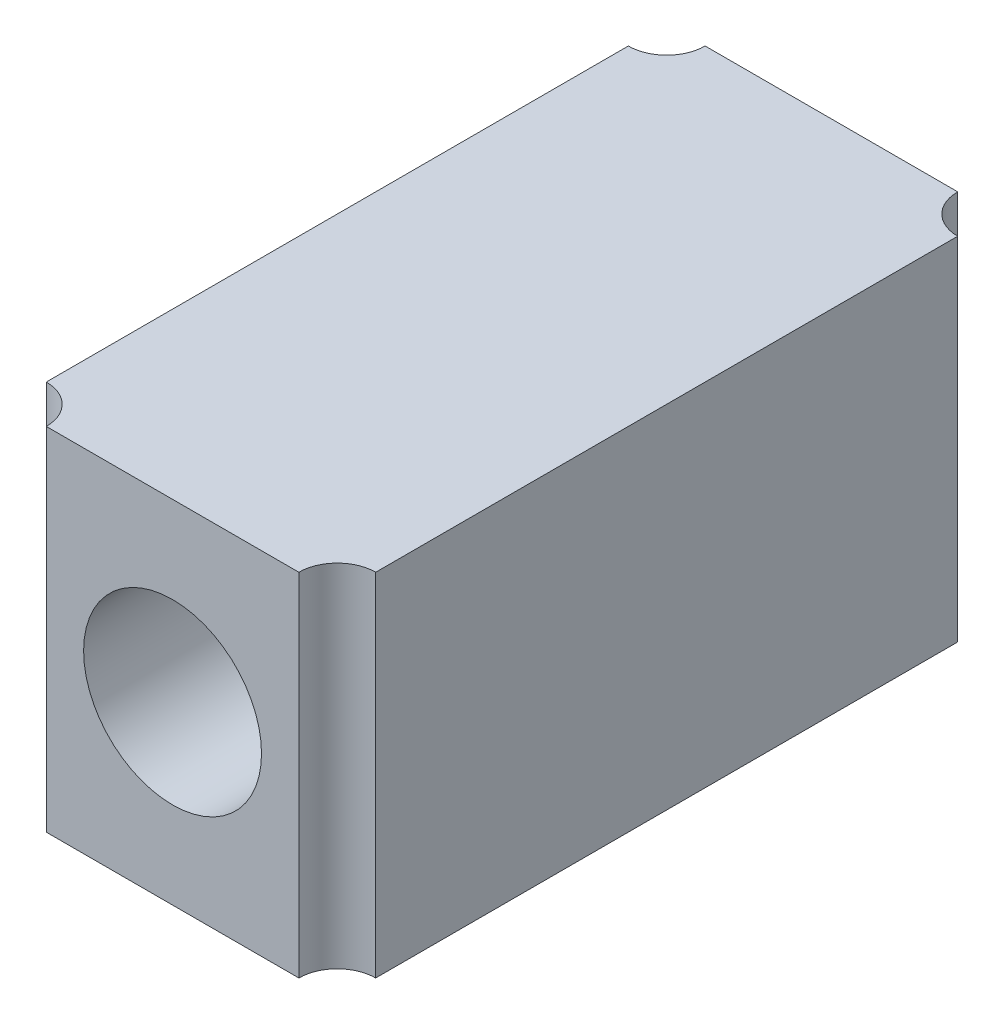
ISO-10303-21;
HEADER;
FILE_DESCRIPTION(('STEP AP214'),'2;1');
FILE_NAME('part.step','',(''),(''),'','','');
FILE_SCHEMA(('AUTOMOTIVE_DESIGN { 1 0 10303 214 1 1 1 1 }'));
ENDSEC;
DATA;
#1=APPLICATION_CONTEXT('core data for automotive mechanical design processes');
#2=APPLICATION_PROTOCOL_DEFINITION('international standard','automotive_design',2000,#1);
#3=PRODUCT_CONTEXT('',#1,'mechanical');
#4=PRODUCT('Part','Part','',(#3));
#5=PRODUCT_RELATED_PRODUCT_CATEGORY('part','',(#4));
#6=PRODUCT_DEFINITION_FORMATION('','',#4);
#7=PRODUCT_DEFINITION_CONTEXT('part definition',#1,'design');
#8=PRODUCT_DEFINITION('design','',#6,#7);
#9=PRODUCT_DEFINITION_SHAPE('','',#8);
#10=(LENGTH_UNIT() NAMED_UNIT(*) SI_UNIT(.MILLI.,.METRE.));
#11=(NAMED_UNIT(*) PLANE_ANGLE_UNIT() SI_UNIT($,.RADIAN.));
#12=(NAMED_UNIT(*) SI_UNIT($,.STERADIAN.) SOLID_ANGLE_UNIT());
#13=UNCERTAINTY_MEASURE_WITH_UNIT(LENGTH_MEASURE(1.E-05),#10,'distance_accuracy_value','');
#14=(GEOMETRIC_REPRESENTATION_CONTEXT(3) GLOBAL_UNCERTAINTY_ASSIGNED_CONTEXT((#13)) GLOBAL_UNIT_ASSIGNED_CONTEXT((#10,
#11,#12)) REPRESENTATION_CONTEXT('',''));
#15=CARTESIAN_POINT('',(0.,0.,0.));
#16=DIRECTION('',(0.,0.,1.));
#17=DIRECTION('',(1.,0.,0.));
#18=AXIS2_PLACEMENT_3D('',#15,#16,#17);
#19=CARTESIAN_POINT('',(0.,0.,30.));
#20=DIRECTION('',(0.,0.,-1.));
#21=DIRECTION('',(-1.,0.,0.));
#22=AXIS2_PLACEMENT_3D('',#19,#20,#21);
#23=PLANE('',#22);
#24=DIRECTION('',(-1.,0.,0.));
#25=VECTOR('',#24,1.);
#26=CARTESIAN_POINT('',(-7.5,8.,30.));
#27=LINE('',#26,#25);
#28=CARTESIAN_POINT('',(5.75,8.,30.));
#29=VERTEX_POINT('',#28);
#30=CARTESIAN_POINT('',(-5.75,8.,30.));
#31=VERTEX_POINT('',#30);
#32=EDGE_CURVE('E113',#29,#31,#27,.T.);
#33=ORIENTED_EDGE('',*,*,#32,.T.);
#34=DIRECTION('',(0.,1.,0.));
#35=VECTOR('',#34,1.);
#36=CARTESIAN_POINT('',(-5.75,-8.,30.));
#37=LINE('',#36,#35);
#38=CARTESIAN_POINT('',(-5.75,-8.,30.));
#39=VERTEX_POINT('',#38);
#40=EDGE_CURVE('E99',#31,#39,#37,.F.);
#41=ORIENTED_EDGE('',*,*,#40,.T.);
#42=DIRECTION('',(1.,0.,0.));
#43=VECTOR('',#42,1.);
#44=CARTESIAN_POINT('',(-7.5,-8.,30.));
#45=LINE('',#44,#43);
#46=CARTESIAN_POINT('',(5.75,-8.,30.));
#47=VERTEX_POINT('',#46);
#48=EDGE_CURVE('E110',#39,#47,#45,.T.);
#49=ORIENTED_EDGE('',*,*,#48,.T.);
#50=DIRECTION('',(0.,1.,0.));
#51=VECTOR('',#50,1.);
#52=CARTESIAN_POINT('',(5.75,-8.,30.));
#53=LINE('',#52,#51);
#54=EDGE_CURVE('E162',#47,#29,#53,.T.);
#55=ORIENTED_EDGE('',*,*,#54,.T.);
#56=EDGE_LOOP('',(#33,#41,#49,#55));
#57=FACE_BOUND('',#56,.T.);
#58=CARTESIAN_POINT('',(0.,0.,30.));
#59=DIRECTION('',(0.,0.,1.));
#60=DIRECTION('',(1.,0.,0.));
#61=AXIS2_PLACEMENT_3D('',#58,#59,#60);
#62=CIRCLE('',#61,4.05);
#63=CARTESIAN_POINT('',(4.05,0.,30.));
#64=VERTEX_POINT('',#63);
#65=EDGE_CURVE('E132',#64,#64,#62,.T.);
#66=ORIENTED_EDGE('',*,*,#65,.F.);
#67=EDGE_LOOP('',(#66));
#68=FACE_BOUND('',#67,.T.);
#69=ADVANCED_FACE('F33',(#57,#68),#23,.F.);
#70=CARTESIAN_POINT('',(0.,0.,0.));
#71=DIRECTION('',(0.,0.,-1.));
#72=DIRECTION('',(-1.,0.,0.));
#73=AXIS2_PLACEMENT_3D('',#70,#71,#72);
#74=PLANE('',#73);
#75=DIRECTION('',(0.,1.,0.));
#76=VECTOR('',#75,1.);
#77=CARTESIAN_POINT('',(-5.75,-8.,0.));
#78=LINE('',#77,#76);
#79=CARTESIAN_POINT('',(-5.75,8.,0.));
#80=VERTEX_POINT('',#79);
#81=CARTESIAN_POINT('',(-5.75,-8.,0.));
#82=VERTEX_POINT('',#81);
#83=EDGE_CURVE('E56',#80,#82,#78,.F.);
#84=ORIENTED_EDGE('',*,*,#83,.F.);
#85=DIRECTION('',(-1.,0.,0.));
#86=VECTOR('',#85,1.);
#87=CARTESIAN_POINT('',(-7.5,8.,0.));
#88=LINE('',#87,#86);
#89=CARTESIAN_POINT('',(5.75,8.,0.));
#90=VERTEX_POINT('',#89);
#91=EDGE_CURVE('E129',#90,#80,#88,.T.);
#92=ORIENTED_EDGE('',*,*,#91,.F.);
#93=DIRECTION('',(0.,1.,0.));
#94=VECTOR('',#93,1.);
#95=CARTESIAN_POINT('',(5.75,-8.,0.));
#96=LINE('',#95,#94);
#97=CARTESIAN_POINT('',(5.75,-8.,0.));
#98=VERTEX_POINT('',#97);
#99=EDGE_CURVE('E153',#98,#90,#96,.T.);
#100=ORIENTED_EDGE('',*,*,#99,.F.);
#101=DIRECTION('',(1.,0.,0.));
#102=VECTOR('',#101,1.);
#103=CARTESIAN_POINT('',(-7.5,-8.,0.));
#104=LINE('',#103,#102);
#105=EDGE_CURVE('E125',#82,#98,#104,.T.);
#106=ORIENTED_EDGE('',*,*,#105,.F.);
#107=EDGE_LOOP('',(#84,#92,#100,#106));
#108=FACE_BOUND('',#107,.T.);
#109=CARTESIAN_POINT('',(0.,0.,0.));
#110=DIRECTION('',(0.,0.,1.));
#111=DIRECTION('',(1.,0.,0.));
#112=AXIS2_PLACEMENT_3D('',#109,#110,#111);
#113=CIRCLE('',#112,4.05);
#114=CARTESIAN_POINT('',(4.05,0.,0.));
#115=VERTEX_POINT('',#114);
#116=EDGE_CURVE('E164',#115,#115,#113,.T.);
#117=ORIENTED_EDGE('',*,*,#116,.T.);
#118=EDGE_LOOP('',(#117));
#119=FACE_BOUND('',#118,.T.);
#120=ADVANCED_FACE('F169',(#108,#119),#74,.T.);
#121=CARTESIAN_POINT('',(7.5,-8.,30.));
#122=DIRECTION('',(-1.,0.,0.));
#123=DIRECTION('',(0.,0.,1.));
#124=AXIS2_PLACEMENT_3D('',#121,#122,#123);
#125=PLANE('',#124);
#126=DIRECTION('',(0.,0.,-1.));
#127=VECTOR('',#126,1.);
#128=CARTESIAN_POINT('',(7.5,-8.,30.));
#129=LINE('',#128,#127);
#130=CARTESIAN_POINT('',(7.5,-8.,28.25));
#131=VERTEX_POINT('',#130);
#132=CARTESIAN_POINT('',(7.5,-8.,1.75));
#133=VERTEX_POINT('',#132);
#134=EDGE_CURVE('E120',#131,#133,#129,.T.);
#135=ORIENTED_EDGE('',*,*,#134,.T.);
#136=DIRECTION('',(0.,1.,0.));
#137=VECTOR('',#136,1.);
#138=CARTESIAN_POINT('',(7.5,-8.,1.75));
#139=LINE('',#138,#137);
#140=CARTESIAN_POINT('',(7.5,8.,1.75));
#141=VERTEX_POINT('',#140);
#142=EDGE_CURVE('E150',#133,#141,#139,.T.);
#143=ORIENTED_EDGE('',*,*,#142,.T.);
#144=DIRECTION('',(0.,0.,-1.));
#145=VECTOR('',#144,1.);
#146=CARTESIAN_POINT('',(7.5,8.,30.));
#147=LINE('',#146,#145);
#148=CARTESIAN_POINT('',(7.5,8.,28.25));
#149=VERTEX_POINT('',#148);
#150=EDGE_CURVE('E41',#149,#141,#147,.T.);
#151=ORIENTED_EDGE('',*,*,#150,.F.);
#152=DIRECTION('',(0.,1.,0.));
#153=VECTOR('',#152,1.);
#154=CARTESIAN_POINT('',(7.5,-8.,28.25));
#155=LINE('',#154,#153);
#156=EDGE_CURVE('E149',#149,#131,#155,.F.);
#157=ORIENTED_EDGE('',*,*,#156,.T.);
#158=EDGE_LOOP('',(#135,#143,#151,#157));
#159=FACE_BOUND('',#158,.T.);
#160=ADVANCED_FACE('F35',(#159),#125,.F.);
#161=CARTESIAN_POINT('',(-7.5,8.,30.));
#162=DIRECTION('',(0.,-1.,0.));
#163=DIRECTION('',(0.,0.,-1.));
#164=AXIS2_PLACEMENT_3D('',#161,#162,#163);
#165=PLANE('',#164);
#166=DIRECTION('',(0.,0.,-1.));
#167=VECTOR('',#166,1.);
#168=CARTESIAN_POINT('',(-7.5,8.,30.));
#169=LINE('',#168,#167);
#170=CARTESIAN_POINT('',(-7.5,8.,28.25));
#171=VERTEX_POINT('',#170);
#172=CARTESIAN_POINT('',(-7.5,8.,1.75));
#173=VERTEX_POINT('',#172);
#174=EDGE_CURVE('E135',#171,#173,#169,.T.);
#175=ORIENTED_EDGE('',*,*,#174,.F.);
#176=CARTESIAN_POINT('',(-7.5,8.,30.));
#177=DIRECTION('',(0.,1.,0.));
#178=DIRECTION('',(0.,0.,1.));
#179=AXIS2_PLACEMENT_3D('',#176,#177,#178);
#180=CIRCLE('',#179,1.75);
#181=EDGE_CURVE('E104',#31,#171,#180,.T.);
#182=ORIENTED_EDGE('',*,*,#181,.F.);
#183=ORIENTED_EDGE('',*,*,#32,.F.);
#184=CARTESIAN_POINT('',(7.5,8.,30.));
#185=DIRECTION('',(0.,1.,0.));
#186=DIRECTION('',(0.,0.,1.));
#187=AXIS2_PLACEMENT_3D('',#184,#185,#186);
#188=CIRCLE('',#187,1.75);
#189=EDGE_CURVE('E145',#149,#29,#188,.T.);
#190=ORIENTED_EDGE('',*,*,#189,.F.);
#191=ORIENTED_EDGE('',*,*,#150,.T.);
#192=CARTESIAN_POINT('',(7.5,8.,0.));
#193=DIRECTION('',(0.,1.,0.));
#194=DIRECTION('',(0.,0.,1.));
#195=AXIS2_PLACEMENT_3D('',#192,#193,#194);
#196=CIRCLE('',#195,1.75);
#197=EDGE_CURVE('E143',#90,#141,#196,.T.);
#198=ORIENTED_EDGE('',*,*,#197,.F.);
#199=ORIENTED_EDGE('',*,*,#91,.T.);
#200=CARTESIAN_POINT('',(-7.5,8.,0.));
#201=DIRECTION('',(0.,1.,0.));
#202=DIRECTION('',(0.,0.,1.));
#203=AXIS2_PLACEMENT_3D('',#200,#201,#202);
#204=CIRCLE('',#203,1.75);
#205=EDGE_CURVE('E114',#173,#80,#204,.T.);
#206=ORIENTED_EDGE('',*,*,#205,.F.);
#207=EDGE_LOOP('',(#175,#182,#183,#190,#191,#198,#199,#206));
#208=FACE_BOUND('',#207,.T.);
#209=ADVANCED_FACE('F142',(#208),#165,.F.);
#210=CARTESIAN_POINT('',(-7.5,-8.,30.));
#211=DIRECTION('',(1.,0.,0.));
#212=DIRECTION('',(0.,0.,-1.));
#213=AXIS2_PLACEMENT_3D('',#210,#211,#212);
#214=PLANE('',#213);
#215=DIRECTION('',(0.,0.,-1.));
#216=VECTOR('',#215,1.);
#217=CARTESIAN_POINT('',(-7.5,-8.,30.));
#218=LINE('',#217,#216);
#219=CARTESIAN_POINT('',(-7.5,-8.,28.25));
#220=VERTEX_POINT('',#219);
#221=CARTESIAN_POINT('',(-7.5,-8.,1.75));
#222=VERTEX_POINT('',#221);
#223=EDGE_CURVE('E123',#220,#222,#218,.T.);
#224=ORIENTED_EDGE('',*,*,#223,.F.);
#225=DIRECTION('',(0.,1.,0.));
#226=VECTOR('',#225,1.);
#227=CARTESIAN_POINT('',(-7.5,-8.,28.25));
#228=LINE('',#227,#226);
#229=EDGE_CURVE('E48',#220,#171,#228,.T.);
#230=ORIENTED_EDGE('',*,*,#229,.T.);
#231=ORIENTED_EDGE('',*,*,#174,.T.);
#232=DIRECTION('',(0.,1.,0.));
#233=VECTOR('',#232,1.);
#234=CARTESIAN_POINT('',(-7.5,-8.,1.75));
#235=LINE('',#234,#233);
#236=EDGE_CURVE('E259',#173,#222,#235,.F.);
#237=ORIENTED_EDGE('',*,*,#236,.T.);
#238=EDGE_LOOP('',(#224,#230,#231,#237));
#239=FACE_BOUND('',#238,.T.);
#240=ADVANCED_FACE('F183',(#239),#214,.F.);
#241=CARTESIAN_POINT('',(-7.5,-8.,30.));
#242=DIRECTION('',(0.,1.,0.));
#243=DIRECTION('',(0.,0.,1.));
#244=AXIS2_PLACEMENT_3D('',#241,#242,#243);
#245=PLANE('',#244);
#246=ORIENTED_EDGE('',*,*,#48,.F.);
#247=CARTESIAN_POINT('',(-7.5,-8.,30.));
#248=DIRECTION('',(0.,1.,0.));
#249=DIRECTION('',(0.,0.,1.));
#250=AXIS2_PLACEMENT_3D('',#247,#248,#249);
#251=CIRCLE('',#250,1.75);
#252=EDGE_CURVE('E96',#39,#220,#251,.T.);
#253=ORIENTED_EDGE('',*,*,#252,.T.);
#254=ORIENTED_EDGE('',*,*,#223,.T.);
#255=CARTESIAN_POINT('',(-7.5,-8.,0.));
#256=DIRECTION('',(0.,1.,0.));
#257=DIRECTION('',(0.,0.,1.));
#258=AXIS2_PLACEMENT_3D('',#255,#256,#257);
#259=CIRCLE('',#258,1.75);
#260=EDGE_CURVE('E257',#222,#82,#259,.T.);
#261=ORIENTED_EDGE('',*,*,#260,.T.);
#262=ORIENTED_EDGE('',*,*,#105,.T.);
#263=CARTESIAN_POINT('',(7.5,-8.,0.));
#264=DIRECTION('',(0.,1.,0.));
#265=DIRECTION('',(0.,0.,1.));
#266=AXIS2_PLACEMENT_3D('',#263,#264,#265);
#267=CIRCLE('',#266,1.75);
#268=EDGE_CURVE('E11',#98,#133,#267,.T.);
#269=ORIENTED_EDGE('',*,*,#268,.T.);
#270=ORIENTED_EDGE('',*,*,#134,.F.);
#271=CARTESIAN_POINT('',(7.5,-8.,30.));
#272=DIRECTION('',(0.,1.,0.));
#273=DIRECTION('',(0.,0.,1.));
#274=AXIS2_PLACEMENT_3D('',#271,#272,#273);
#275=CIRCLE('',#274,1.75);
#276=EDGE_CURVE('E119',#131,#47,#275,.T.);
#277=ORIENTED_EDGE('',*,*,#276,.T.);
#278=EDGE_LOOP('',(#246,#253,#254,#261,#262,#269,#270,#277));
#279=FACE_BOUND('',#278,.T.);
#280=ADVANCED_FACE('F117',(#279),#245,.F.);
#281=CARTESIAN_POINT('',(0.,0.,30.));
#282=DIRECTION('',(0.,0.,-1.));
#283=DIRECTION('',(-1.,0.,0.));
#284=AXIS2_PLACEMENT_3D('',#281,#282,#283);
#285=CYLINDRICAL_SURFACE('',#284,4.05);
#286=ORIENTED_EDGE('',*,*,#65,.T.);
#287=EDGE_LOOP('',(#286));
#288=FACE_BOUND('',#287,.T.);
#289=ORIENTED_EDGE('',*,*,#116,.F.);
#290=EDGE_LOOP('',(#289));
#291=FACE_BOUND('',#290,.T.);
#292=ADVANCED_FACE('F171',(#288,#291),#285,.F.);
#293=CARTESIAN_POINT('',(7.5,-8.,30.));
#294=DIRECTION('',(0.,1.,0.));
#295=DIRECTION('',(0.,0.,1.));
#296=AXIS2_PLACEMENT_3D('',#293,#294,#295);
#297=CYLINDRICAL_SURFACE('',#296,1.75);
#298=ORIENTED_EDGE('',*,*,#276,.F.);
#299=ORIENTED_EDGE('',*,*,#156,.F.);
#300=ORIENTED_EDGE('',*,*,#189,.T.);
#301=ORIENTED_EDGE('',*,*,#54,.F.);
#302=EDGE_LOOP('',(#298,#299,#300,#301));
#303=FACE_BOUND('',#302,.T.);
#304=ADVANCED_FACE('F173',(#303),#297,.F.);
#305=CARTESIAN_POINT('',(7.5,-8.,0.));
#306=DIRECTION('',(0.,1.,0.));
#307=DIRECTION('',(0.,0.,1.));
#308=AXIS2_PLACEMENT_3D('',#305,#306,#307);
#309=CYLINDRICAL_SURFACE('',#308,1.75);
#310=ORIENTED_EDGE('',*,*,#99,.T.);
#311=ORIENTED_EDGE('',*,*,#197,.T.);
#312=ORIENTED_EDGE('',*,*,#142,.F.);
#313=ORIENTED_EDGE('',*,*,#268,.F.);
#314=EDGE_LOOP('',(#310,#311,#312,#313));
#315=FACE_BOUND('',#314,.T.);
#316=ADVANCED_FACE('F180',(#315),#309,.F.);
#317=CARTESIAN_POINT('',(-7.5,-8.,0.));
#318=DIRECTION('',(0.,1.,0.));
#319=DIRECTION('',(0.,0.,1.));
#320=AXIS2_PLACEMENT_3D('',#317,#318,#319);
#321=CYLINDRICAL_SURFACE('',#320,1.75);
#322=ORIENTED_EDGE('',*,*,#83,.T.);
#323=ORIENTED_EDGE('',*,*,#260,.F.);
#324=ORIENTED_EDGE('',*,*,#236,.F.);
#325=ORIENTED_EDGE('',*,*,#205,.T.);
#326=EDGE_LOOP('',(#322,#323,#324,#325));
#327=FACE_BOUND('',#326,.T.);
#328=ADVANCED_FACE('F233',(#327),#321,.F.);
#329=CARTESIAN_POINT('',(-7.5,-8.,30.));
#330=DIRECTION('',(0.,1.,0.));
#331=DIRECTION('',(0.,0.,1.));
#332=AXIS2_PLACEMENT_3D('',#329,#330,#331);
#333=CYLINDRICAL_SURFACE('',#332,1.75);
#334=ORIENTED_EDGE('',*,*,#181,.T.);
#335=ORIENTED_EDGE('',*,*,#229,.F.);
#336=ORIENTED_EDGE('',*,*,#252,.F.);
#337=ORIENTED_EDGE('',*,*,#40,.F.);
#338=EDGE_LOOP('',(#334,#335,#336,#337));
#339=FACE_BOUND('',#338,.T.);
#340=ADVANCED_FACE('F98',(#339),#333,.F.);
#341=CLOSED_SHELL('',(#69,#120,#160,#209,#240,#280,#292,#304,#316,#328,#340));
#342=MANIFOLD_SOLID_BREP('B2',#341);
#343=ADVANCED_BREP_SHAPE_REPRESENTATION('',(#18,#342),#14);
#344=SHAPE_DEFINITION_REPRESENTATION(#9,#343);
ENDSEC;
END-ISO-10303-21;
